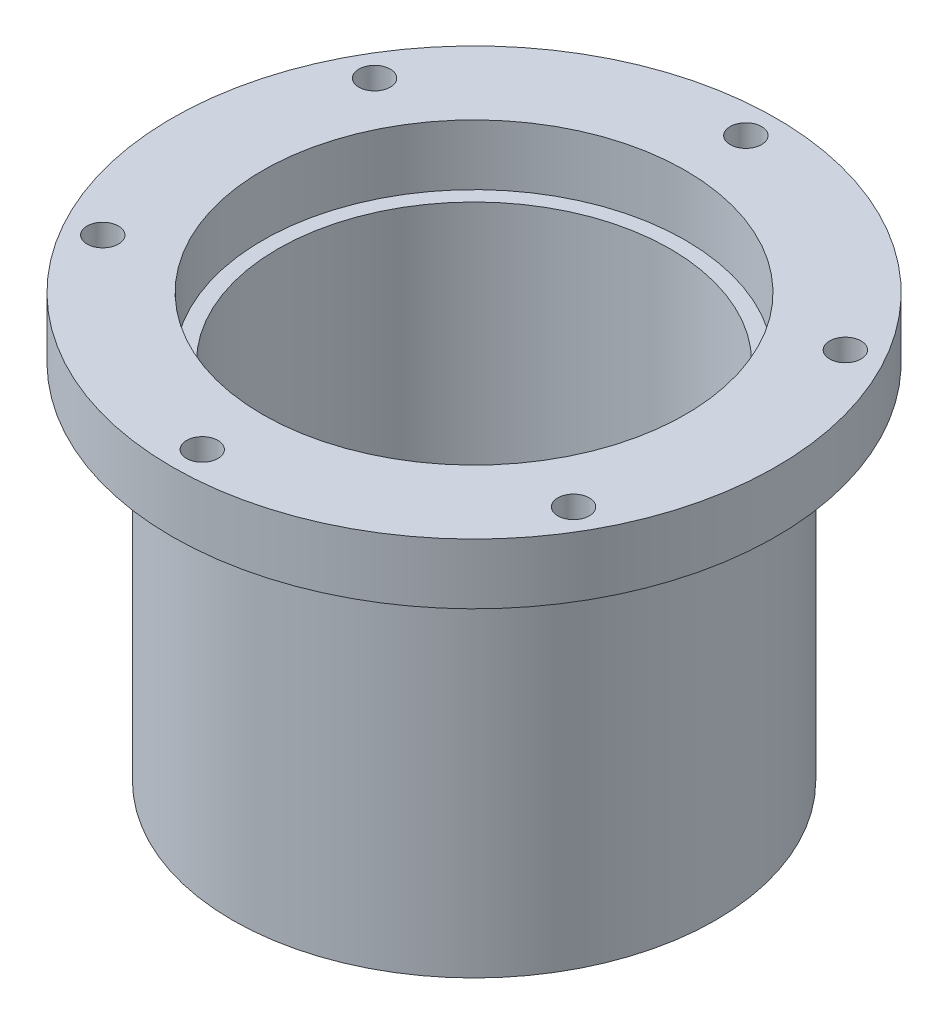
from build123d import *

# Parameters (mm, degrees)
SKETCH2_R          = 3.117806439
CUT_EXTRUDE1_DEPTH = 127.363404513
CIRPATTERN1_COUNT  = 4
SKETCH3_R          = 3.302
CUT_EXTRUDE2_DEPTH = 127.363404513
CIRPATTERN2_COUNT  = 6


with BuildPart() as part:
    # Sketch1 → Revolve1 (revolve)
    with BuildSketch(Plane.XY, mode=Mode.PRIVATE) as revolve1_sk:
        Polygon((22.225, 0), (25.2222, 0), (25.2222, -5.207), (50.8, -5.207), (50.8, 70.993), (63.5, 70.993), (63.5, 83.693), (44.45, 83.693), (44.45, 70.993), (41.275, 70.993), (41.275, 4.7498), (22.225, 4.7498), align=None)
    revolve(revolve1_sk.sketch.rotate(Axis((0, 77.365831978, 0), (0, -1, 0)), 90), axis=Axis((0, 77.365831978, 0), (0, -1, 0)))

    # Sketch2 → Cut-Extrude1 (cut, through all)
    with BuildSketch(Plane.XZ.offset(5.207)):
        with Locations(Location((0, 32.766, 0), (0, 0, 270))):
            Circle(SKETCH2_R)
    cut_extrude1 = extrude(amount=-CUT_EXTRUDE1_DEPTH, mode=Mode.SUBTRACT)

    # CirPattern1: Cut-Extrude1 ×4 about axis
    cirpattern1_axis = Axis((0, 0, 0), (0, 1, 0))
    for i in range(1, CIRPATTERN1_COUNT):
        add(cut_extrude1.rotate(cirpattern1_axis, i * 360 / CIRPATTERN1_COUNT), mode=Mode.SUBTRACT)

    # Sketch3 → Cut-Extrude2 (cut, through all)
    with BuildSketch(Plane(origin=(0, 83.693, 0), x_dir=(-1, 0, 0), z_dir=(0, 1, 0))):
        with Locations(Location((0, -57.15, 0), (0, 0, 90))):
            Circle(SKETCH3_R)
    cut_extrude2 = extrude(amount=-CUT_EXTRUDE2_DEPTH, mode=Mode.SUBTRACT)

    # CirPattern2: Cut-Extrude2 ×6 about axis
    cirpattern2_axis = Axis((0, 0, 0), (0, 1, 0))
    for i in range(1, CIRPATTERN2_COUNT):
        add(cut_extrude2.rotate(cirpattern2_axis, i * 360 / CIRPATTERN2_COUNT), mode=Mode.SUBTRACT)


solid = part.part
